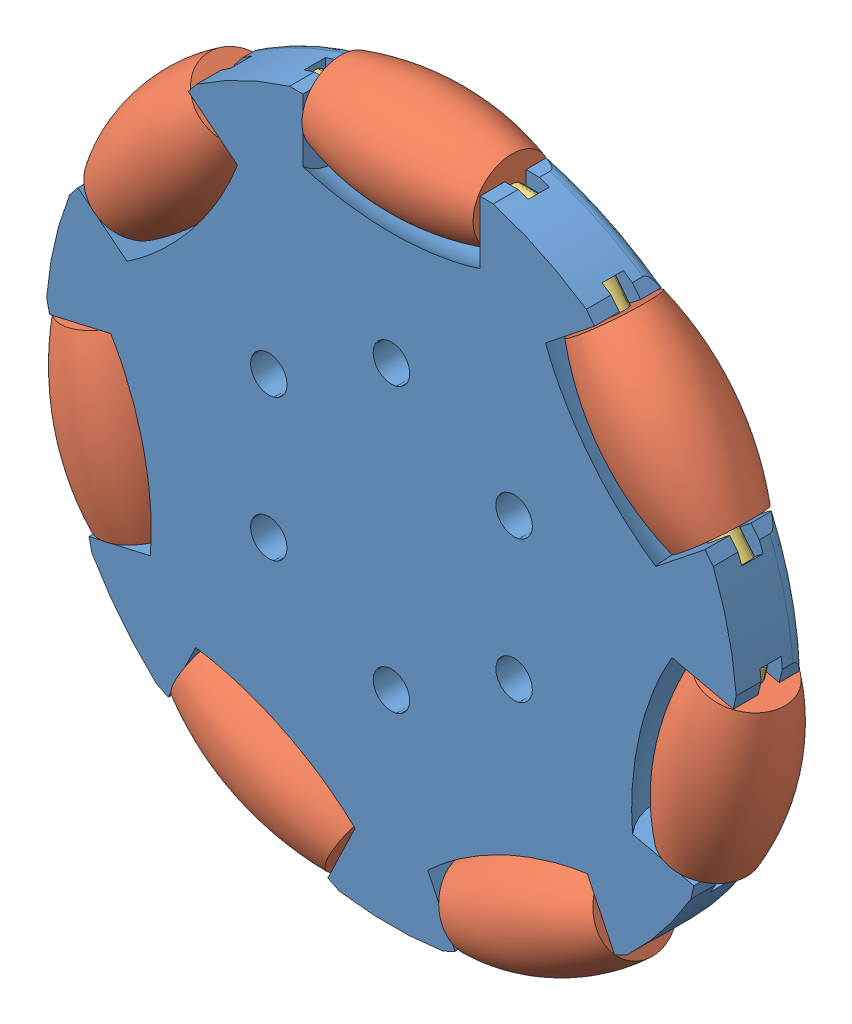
SolidWorks assembly OmniRueda.SLDASM, configuration Default (file format 9000). Lengths in mm.
Overall size (64.63 62.32 12.37).
15 component instances, 3 part files, 21 mates.
Components (placement in the parent):
- base1-1: base1.SLDPRT [Default] at (21.7624 30.7176 48.3759) size (58.67 57.3 6.07)
- tambor-1: tambor.SLDPRT [Default] at (21.7309 56.8764 48.3759) size (14.5 8.8 8.8)
- tambor-2: tambor.SLDPRT [Default] at (42.1534 47.1036 48.3759) x (0.62349 -0.781831 0) z (0.006132 0.00489 0.999969) size (14.5 8.8 8.8)
- tambor-3: tambor.SLDPRT [Default] at (1.401 47.1407 48.3759) x (0.62349 0.781831 0) z (-0.451651 0.36018 0.816261) size (14.5 8.8 8.8)
- tambor-4: tambor.SLDPRT [Default] at (47.2654 24.8969 48.3759) x (0.222521 0.974928 0) z (-0.021105 0.004817 0.999766) size (14.5 8.8 8.8)
- tambor-5: tambor.SLDPRT [Default] at (-3.7307 24.8536 48.3759) x (0.222521 -0.974928 0) z (-0.760422 -0.173561 0.625808) size (14.5 8.8 8.8)
- tambor-6: tambor.SLDPRT [Default] at (32.8971 7.0457 48.3759) x (0.900969 0.433884 0) z (-0.125061 0.259692 0.957559) size (14.5 8.8 8.8)
- tambor-7: tambor.SLDPRT [Default] at (10.1902 7.2564 48.3759) x (0.900969 -0.433884 0) z (0.089476 0.185799 0.978505) size (14.5 8.8 8.8)
- Part1-1: Part1.SLDPRT [Default] at (31.2613 56.8764 48.3759) x (0 -0.961459 -0.274948) z (-1 0 0) size (2.2 2.2 19)
- Part1-2: Part1.SLDPRT [Default] at (7.2331 54.4539 48.3759) x (0.669349 -0.533788 -0.516762) z (-0.62349 -0.781831 0) size (2.2 2.2 19)
- Part1-3: Part1.SLDPRT [Default] at (48.1367 39.6008 48.3759) x (-0.207776 -0.165696 0.964041) z (-0.62349 0.781831 0) size (2.2 2.2 19)
- Part1-4: Part1.SLDPRT [Default] at (49.3796 34.1596 48.3759) x (-0.649686 0.148286 0.7456) z (-0.222521 -0.974928 0) size (2.2 2.2 19)
- Part1-5: Part1.SLDPRT [Default] at (18.9727 3.0269 48.3759) x (0.3295 0.684213 0.650602) z (-0.900969 0.433884 0) size (2.2 2.2 19)
- Part1-6: Part1.SLDPRT [Default] at (41.6725 11.2717 48.3759) x (-0.412763 0.857111 0.308201) z (-0.900969 -0.433884 0) size (2.2 2.2 19)
- Part1-7: Part1.SLDPRT [Default] at (-1.6264 15.6338 48.3759) x (0.950484 0.216942 0.222521) z (-0.222521 0.974928 0) size (2.2 2.2 19)
Mates (geometry in assembly coordinates):
- Coincident3: coincident anti-aligned: circle of base1-1; cylinder of tambor-1 through (28.9809 56.8764 48.3759) axis (-1 0 0) radius 1.1
- Coincident4: coincident anti-aligned: circle of base1-1; cylinder of tambor-2 through (46.6737 41.4353 48.3759) axis (-0.62349 0.781831 0) radius 1.1
- Coincident5: coincident anti-aligned: circle of base1-1; cylinder of tambor-3 through (5.9213 52.809 48.3759) axis (-0.62349 -0.781831 0) radius 1.1
- Coincident6: coincident aligned: circle of base1-1; cylinder of tambor-5 through (-2.1174 17.7853 48.3759) axis (-0.222521 0.974928 0) radius 1.1
- Coincident7: coincident aligned: circle of base1-1; cylinder of tambor-7 through (16.7223 4.1107 48.3759) axis (-0.900969 0.433884 0) radius 1.1
- Coincident8: coincident aligned: circle of base1-1; cylinder of tambor-6 through (39.4291 10.1913 48.3759) axis (-0.900969 -0.433884 0) radius 1.1
- Coincident9: coincident aligned: circle of base1-1; cylinder of tambor-4 through (48.8787 31.9651 48.3759) axis (-0.222521 -0.974928 0) radius 1.1
- Coincident12: coincident aligned: circle of base1-1; cylinder of Part1-1 through (12.2613 56.8764 48.3759) axis (1 0 0) radius 1.1
- Coincident13: coincident anti-aligned: circle of base1-1; circle of Part1-1
- Concentric1: concentric anti-aligned: cylinder of tambor-3 through (5.9213 52.809 48.3759) axis (-0.62349 -0.781831 0) radius 1.1; cylinder of Part1-2 through (-4.6132 39.5991 48.3759) axis (0.62349 0.781831 0) radius 1.1
- Coincident14: coincident anti-aligned: circle of base1-1; circle of Part1-2
- Concentric2: concentric anti-aligned: cylinder of tambor-2 through (46.6737 41.4353 48.3759) axis (-0.62349 0.781831 0) radius 1.1; cylinder of Part1-3 through (36.2904 54.4556 48.3759) axis (0.62349 -0.781831 0) radius 1.1
- Coincident15: coincident anti-aligned: circle of base1-1; circle of Part1-3
- Concentric3: concentric anti-aligned: cylinder of base1-1 through (49.3796 34.1596 48.3759) axis (-0.222521 -0.974928 0) radius 1.1; cylinder of Part1-4 through (45.1517 15.6359 48.3759) axis (0.222521 0.974928 0) radius 1.1
- Coincident16: coincident aligned: circle of base1-1; circle of Part1-4
- Concentric4: concentric anti-aligned: cylinder of base1-1 through (41.6725 11.2717 48.3759) axis (-0.900969 -0.433884 0) radius 1.1; cylinder of Part1-6 through (24.5541 3.0279 48.3759) axis (0.900969 0.433884 0) radius 1.1
- Coincident18: coincident aligned: circle of base1-1; circle of Part1-6
- Concentric5: concentric anti-aligned: cylinder of base1-1 through (18.9727 3.0269 48.3759) axis (-0.900969 0.433884 0) radius 1.1; cylinder of Part1-5 through (1.8543 11.2707 48.3759) axis (0.900969 -0.433884 0) radius 1.1
- Coincident19: coincident aligned: circle of base1-1; circle of Part1-5
- Concentric6: concentric anti-aligned: cylinder of base1-1 through (-1.6264 15.6338 48.3759) axis (-0.222521 0.974928 0) radius 1.1; cylinder of Part1-7 through (-5.8542 34.1575 48.3759) axis (0.222521 -0.974928 0) radius 1.1
- Coincident20: coincident aligned: circle of base1-1; circle of Part1-7
